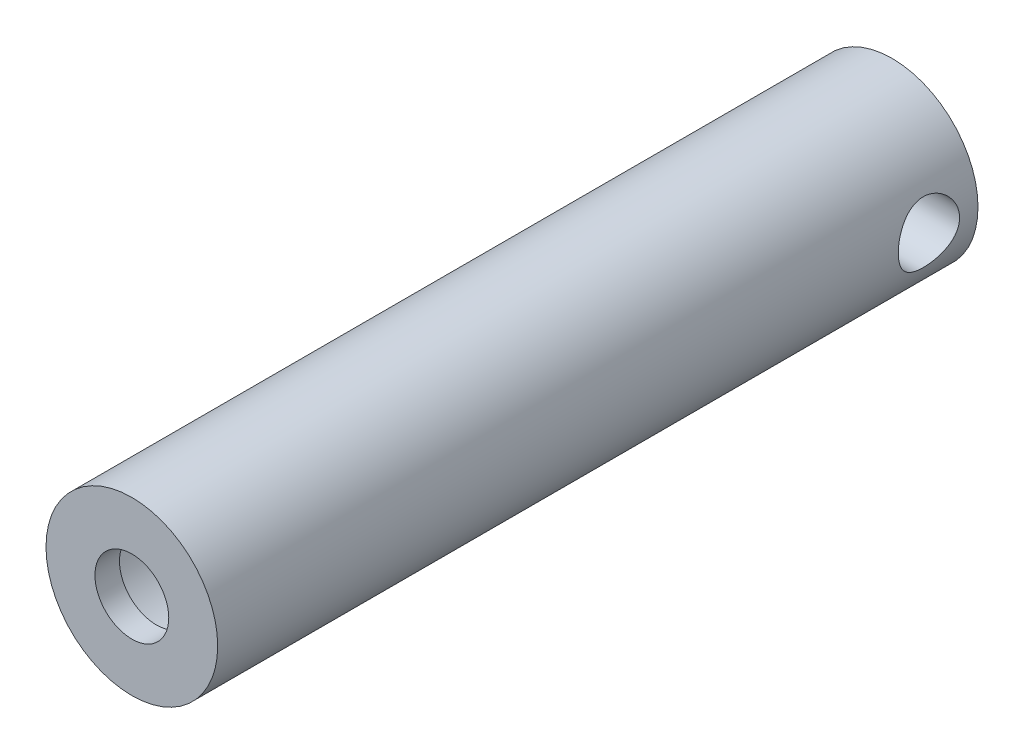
from build123d import *

# Parameters (mm, degrees)
ESQUISSE1_R                  = 35
BASE_EXTRUSION_DEPTH         = 50
ESQUISSE2_R                  = 35
ESQUISSE2_R_2                = 30
BOSS_EXTRU_MINCE1_DEPTH      = 250
ESQUISSE3_R                  = 35
ESQUISSE3_R_2                = 15.05
BOSS_EXTRU_1_DEPTH           = 10
ESQUISSE4_R                  = 12.5
ENL_V_MAT_EXTRU_1_DEPTH      = 43
ENL_V_MAT_EXTRU_2_REACH      = 315.927
ENL_V_MAT_EXTRU_2_END_RADIUS = 35
ESQUISSE5_R                  = 2.75


with BuildPart() as part:
    # Esquisse1 → Base-Extrusion (new body)
    with BuildSketch(Plane.XY):
        Circle(ESQUISSE1_R)
    extrude(amount=BASE_EXTRUSION_DEPTH)

    # Esquisse2 → Boss.-Extru.-Mince1 (add)
    with BuildSketch(Plane.XY.offset(50)):
        Circle(ESQUISSE2_R)
        Circle(ESQUISSE2_R_2, mode=Mode.SUBTRACT)
    extrude(amount=BOSS_EXTRU_MINCE1_DEPTH)

    # Esquisse3 → Boss.-Extru.1 (add)
    with BuildSketch(Plane.XY.offset(300)):
        Circle(ESQUISSE3_R)
        Circle(ESQUISSE3_R_2, mode=Mode.SUBTRACT)
    extrude(amount=BOSS_EXTRU_1_DEPTH)

    # Esquisse4 → Enl_v. mat.-Extru.1 (cut, symmetric)
    with BuildSketch(Plane(origin=(0, 0, 0), x_dir=(0, 0, -1), z_dir=(1, 0, 0))):
        with Locations(Location((-20, 0, 0), (0, 0, 180))):
            Circle(ESQUISSE4_R)
    extrude(amount=ENL_V_MAT_EXTRU_1_DEPTH, both=True, mode=Mode.SUBTRACT)

    # Enl_v. mat.-Extru.2: up to this cylinder (the profile starts inside it)
    enl_v_mat_extru_2_end = Plane(origin=(0, 0, 20), z_dir=(0, 0, -1)) * Cylinder(ENL_V_MAT_EXTRU_2_END_RADIUS, 702.854, mode=Mode.PRIVATE)
    # Esquisse5 → Enl_v. mat.-Extru.2 (cut, up to the surface)
    with BuildSketch(Plane(origin=(0, 0, 0), x_dir=(1, 0, 0), z_dir=(0, 1, 0)), mode=Mode.PRIVATE) as enl_v_mat_extru_2_sk1:
        with Locations(Location((0, -20, 0), (0, 0, 270))):
            Circle(ESQUISSE5_R)
    enl_v_mat_extru_2_tool1 = extrude(enl_v_mat_extru_2_sk1.sketch, amount=-ENL_V_MAT_EXTRU_2_REACH, mode=Mode.PRIVATE) & enl_v_mat_extru_2_end
    add(enl_v_mat_extru_2_tool1.solids().sort_by_distance((0, 0, 20))[0], mode=Mode.SUBTRACT)


solid = part.part
